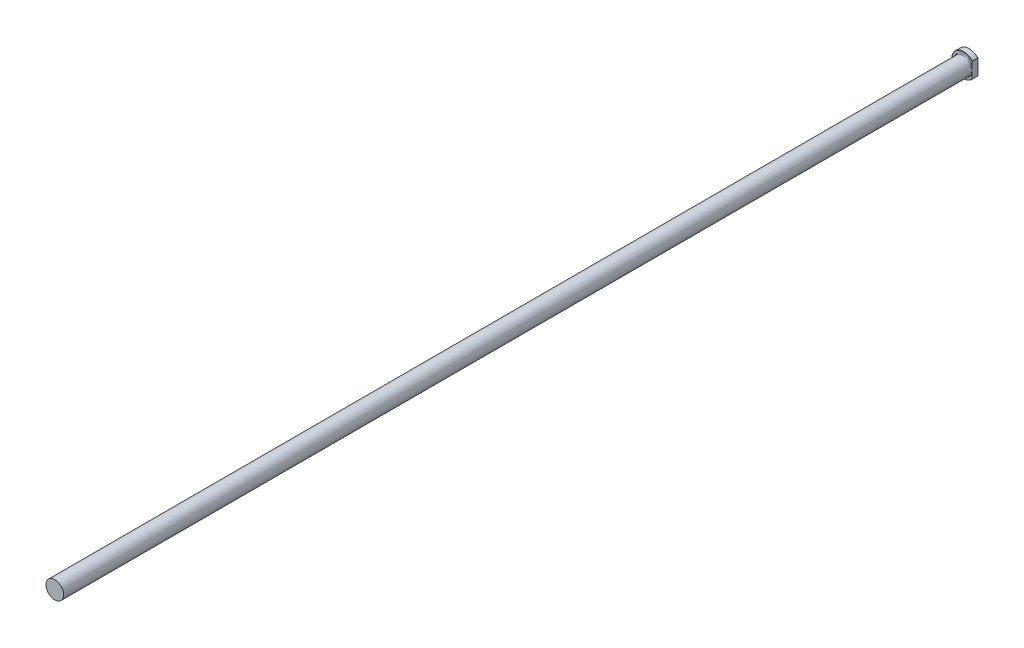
from build123d import *

# Parameters (mm, degrees)
CUT_EXTRUDE2_START = 7.62
CUT_EXTRUDE2_DEPTH = 7.62
CHAMFER1_SIZE      = 0.254


with BuildPart() as part:
    # Sketch2 → Revolve1 (revolve)
    with BuildSketch(Plane(origin=(0, 0, 0), x_dir=(0, 0, 1), z_dir=(1, 0, 0)), mode=Mode.PRIVATE) as revolve1_sk:
        with BuildLine():
            Line((990.6, 0), (0, 0))
            Line((0, 0), (0, 12.7))
            Line((0, 12.7), (6.35, 12.7))
            Line((6.35, 12.7), (6.35, 10.287))
            ThreePointArc((6.35, 10.287), (6.573184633, 9.748184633), (7.112, 9.525))
            Line((7.112, 9.525), (990.6, 9.525))
            Line((990.6, 9.525), (990.6, 0))
        make_face()
    revolve(revolve1_sk.sketch.rotate(Axis((0, 0, -2.147539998), (0, 0, 1)), 270), axis=Axis((0, 0, -2.147539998), (0, 0, 1)))

    # Sketch4 → Cut-Extrude2 (cut)
    with BuildSketch(Plane.XY.offset(CUT_EXTRUDE2_START)):
        with BuildLine():
            Line((9.525, 8.400260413), (9.525, -8.400260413))
            ThreePointArc((9.525, -8.400260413), (12.7, 0), (9.525, 8.400260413))
        make_face()
    extrude(amount=-CUT_EXTRUDE2_DEPTH, mode=Mode.SUBTRACT)

    # Chamfer1
    chamfer1_edges = [part.edges().sort_by_distance(p)[0] for p in [
        (-12.7, 0, 6.35),
        (-12.7, 0, 0),
    ]]
    chamfer(chamfer1_edges, length=CHAMFER1_SIZE)


solid = part.part
